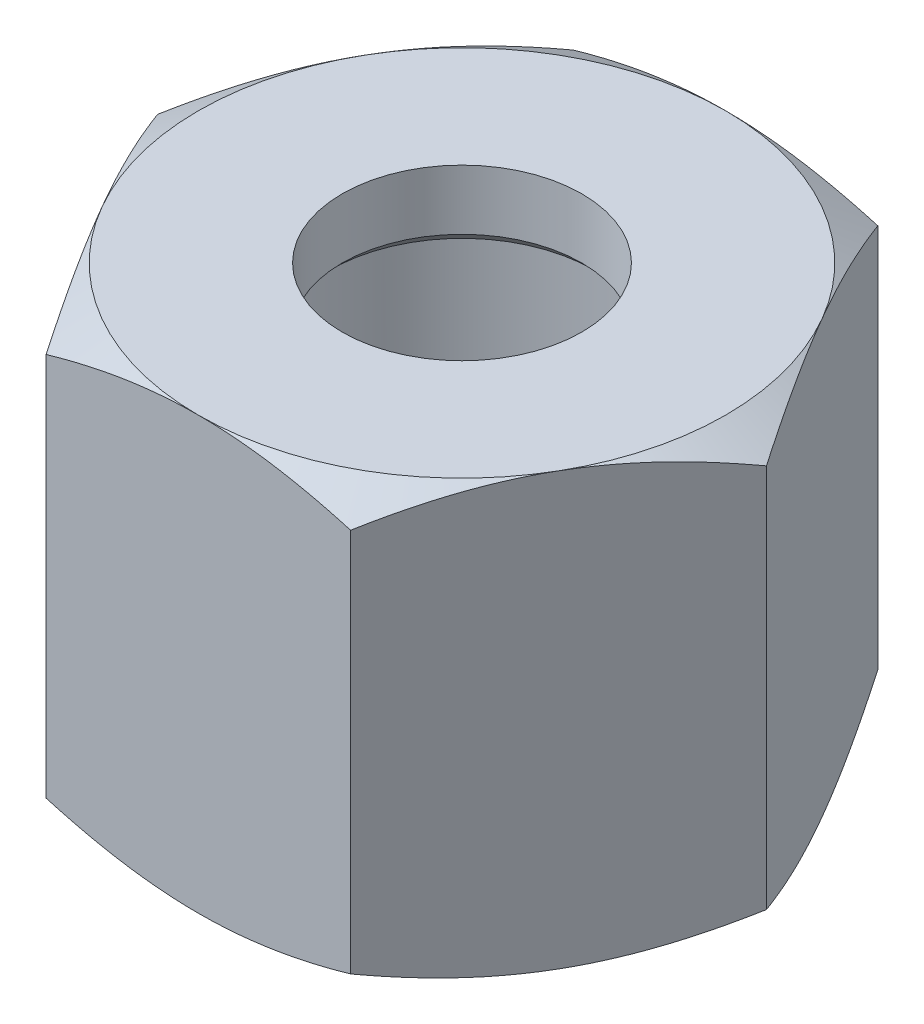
ISO-10303-21;
HEADER;
FILE_DESCRIPTION(('STEP AP214'),'2;1');
FILE_NAME('part.step','',(''),(''),'','','');
FILE_SCHEMA(('AUTOMOTIVE_DESIGN { 1 0 10303 214 1 1 1 1 }'));
ENDSEC;
DATA;
#1=APPLICATION_CONTEXT('core data for automotive mechanical design processes');
#2=APPLICATION_PROTOCOL_DEFINITION('international standard','automotive_design',2000,#1);
#3=PRODUCT_CONTEXT('',#1,'mechanical');
#4=PRODUCT('Part','Part','',(#3));
#5=PRODUCT_RELATED_PRODUCT_CATEGORY('part','',(#4));
#6=PRODUCT_DEFINITION_FORMATION('','',#4);
#7=PRODUCT_DEFINITION_CONTEXT('part definition',#1,'design');
#8=PRODUCT_DEFINITION('design','',#6,#7);
#9=PRODUCT_DEFINITION_SHAPE('','',#8);
#10=(LENGTH_UNIT() NAMED_UNIT(*) SI_UNIT(.MILLI.,.METRE.));
#11=(NAMED_UNIT(*) PLANE_ANGLE_UNIT() SI_UNIT($,.RADIAN.));
#12=(NAMED_UNIT(*) SI_UNIT($,.STERADIAN.) SOLID_ANGLE_UNIT());
#13=UNCERTAINTY_MEASURE_WITH_UNIT(LENGTH_MEASURE(1.E-05),#10,'distance_accuracy_value','');
#14=(GEOMETRIC_REPRESENTATION_CONTEXT(3) GLOBAL_UNCERTAINTY_ASSIGNED_CONTEXT((#13)) GLOBAL_UNIT_ASSIGNED_CONTEXT((#10,
#11,#12)) REPRESENTATION_CONTEXT('',''));
#15=CARTESIAN_POINT('',(0.,0.,0.));
#16=DIRECTION('',(0.,0.,1.));
#17=DIRECTION('',(1.,0.,0.));
#18=AXIS2_PLACEMENT_3D('',#15,#16,#17);
#19=CARTESIAN_POINT('',(6.35085296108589,18.,11.));
#20=DIRECTION('',(-0.866025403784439,0.,-0.5));
#21=DIRECTION('',(-0.5,0.,0.866025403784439));
#22=AXIS2_PLACEMENT_3D('',#19,#20,#21);
#23=PLANE('',#22);
#24=CARTESIAN_POINT('',(12.7018213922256,0.982547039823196,-0.000200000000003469));
#25=CARTESIAN_POINT('',(12.5622159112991,0.901959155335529,0.241603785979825));
#26=CARTESIAN_POINT('',(12.4220899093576,0.825028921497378,0.48430914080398));
#27=CARTESIAN_POINT('',(12.1407142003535,0.67949864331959,0.971666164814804));
#28=CARTESIAN_POINT('',(11.999464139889,0.610901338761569,1.21631844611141));
#29=CARTESIAN_POINT('',(11.5734380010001,0.418936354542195,1.9542173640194));
#30=CARTESIAN_POINT('',(11.2869801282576,0.309747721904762,2.45037695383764));
#31=CARTESIAN_POINT('',(10.8583090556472,0.181714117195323,3.19285703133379));
#32=CARTESIAN_POINT('',(10.7173765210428,0.145242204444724,3.43695934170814));
#33=CARTESIAN_POINT('',(10.4348589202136,0.0840813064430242,3.92629418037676));
#34=CARTESIAN_POINT('',(10.2932738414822,0.0593925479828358,4.17152673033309));
#35=CARTESIAN_POINT('',(10.0098676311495,0.0224303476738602,4.66240068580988));
#36=CARTESIAN_POINT('',(9.86804698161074,0.0101421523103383,4.90804125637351));
#37=CARTESIAN_POINT('',(9.58427426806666,-0.00175707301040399,5.39955001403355));
#38=CARTESIAN_POINT('',(9.44232220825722,-0.00136849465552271,5.64541819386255));
#39=CARTESIAN_POINT('',(9.17694200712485,0.0112011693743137,6.10507018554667));
#40=CARTESIAN_POINT('',(9.05349494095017,0.0218490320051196,6.31888677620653));
#41=CARTESIAN_POINT('',(8.80688473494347,0.0525316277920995,6.74602818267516));
#42=CARTESIAN_POINT('',(8.68372161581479,0.0725670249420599,6.9593529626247));
#43=CARTESIAN_POINT('',(8.43774623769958,0.12167538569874,7.38539481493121));
#44=CARTESIAN_POINT('',(8.31493435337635,0.150755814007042,7.59811123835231));
#45=CARTESIAN_POINT('',(8.0698863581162,0.217443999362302,8.02254681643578));
#46=CARTESIAN_POINT('',(7.94765028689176,0.255052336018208,8.23426590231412));
#47=CARTESIAN_POINT('',(7.5765957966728,0.38161991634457,8.87695113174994));
#48=CARTESIAN_POINT('',(7.32885191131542,0.483199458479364,9.30605612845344));
#49=CARTESIAN_POINT('',(6.83705838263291,0.713743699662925,10.1578675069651));
#50=CARTESIAN_POINT('',(6.59300244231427,0.842654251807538,10.580584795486));
#51=CARTESIAN_POINT('',(6.35073749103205,0.982547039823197,11.0002));
#52=B_SPLINE_CURVE_WITH_KNOTS('',3,(#24,#25,#26,#27,#28,#29,#30,#31,#32,#33,#34,#35,#36,#37,#38,
#39,#40,#41,#42,#43,#44,#45,#46,#47,#48,#49,#50,#51),.UNSPECIFIED.,.F.,.F.,(4,2,2,2,2,2,2,2,2,2,
2,2,2,4),(0.,0.871755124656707,1.74379610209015,3.49159027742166,4.34403665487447,
5.19649943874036,6.0479468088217,6.89936787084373,7.64056020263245,8.38180496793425,
9.12366309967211,9.86557166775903,11.3820155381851,12.8954827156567),.UNSPECIFIED.);
#53=CARTESIAN_POINT('',(12.7017059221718,0.982480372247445,0.));
#54=VERTEX_POINT('',#53);
#55=CARTESIAN_POINT('',(9.52627944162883,0.,5.5));
#56=VERTEX_POINT('',#55);
#57=EDGE_CURVE('E53',#54,#56,#52,.T.);
#58=ORIENTED_EDGE('',*,*,#57,.F.);
#59=DIRECTION('',(0.,-1.,0.));
#60=VECTOR('',#59,1.);
#61=CARTESIAN_POINT('',(12.7017059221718,18.,0.));
#62=LINE('',#61,#60);
#63=CARTESIAN_POINT('',(12.7017059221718,17.0175196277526,0.));
#64=VERTEX_POINT('',#63);
#65=EDGE_CURVE('E172',#64,#54,#62,.T.);
#66=ORIENTED_EDGE('',*,*,#65,.F.);
#67=CARTESIAN_POINT('',(6.35073749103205,17.0174529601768,11.0002));
#68=CARTESIAN_POINT('',(6.49034297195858,17.0980408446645,10.7583962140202));
#69=CARTESIAN_POINT('',(6.63046897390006,17.1749710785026,10.515690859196));
#70=CARTESIAN_POINT('',(6.91184468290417,17.3205013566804,10.0283338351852));
#71=CARTESIAN_POINT('',(7.05309474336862,17.3890986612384,9.78368155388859));
#72=CARTESIAN_POINT('',(7.47912088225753,17.5810636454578,9.04578263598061));
#73=CARTESIAN_POINT('',(7.76557875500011,17.6902522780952,8.54962304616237));
#74=CARTESIAN_POINT('',(8.19424982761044,17.8182858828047,7.80714296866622));
#75=CARTESIAN_POINT('',(8.33518236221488,17.8547577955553,7.56304065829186));
#76=CARTESIAN_POINT('',(8.61769996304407,17.915918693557,7.07370581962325));
#77=CARTESIAN_POINT('',(8.75928504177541,17.9406074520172,6.82847326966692));
#78=CARTESIAN_POINT('',(9.04269125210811,17.9775696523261,6.33759931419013));
#79=CARTESIAN_POINT('',(9.18451190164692,17.9898578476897,6.0919587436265));
#80=CARTESIAN_POINT('',(9.468284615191,18.0017570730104,5.60044998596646));
#81=CARTESIAN_POINT('',(9.61023667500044,18.0013684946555,5.35458180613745));
#82=CARTESIAN_POINT('',(9.87561687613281,17.9887988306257,4.89492981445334));
#83=CARTESIAN_POINT('',(9.99906394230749,17.9781509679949,4.68111322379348));
#84=CARTESIAN_POINT('',(10.2456741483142,17.9474683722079,4.25397181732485));
#85=CARTESIAN_POINT('',(10.3688372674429,17.9274329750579,4.04064703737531));
#86=CARTESIAN_POINT('',(10.6148126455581,17.8783246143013,3.6146051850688));
#87=CARTESIAN_POINT('',(10.7376245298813,17.849244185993,3.4018887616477));
#88=CARTESIAN_POINT('',(10.9826725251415,17.7825560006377,2.97745318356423));
#89=CARTESIAN_POINT('',(11.1049085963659,17.7449476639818,2.76573409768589));
#90=CARTESIAN_POINT('',(11.4759630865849,17.6183800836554,2.12304886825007));
#91=CARTESIAN_POINT('',(11.7237069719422,17.5168005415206,1.69394387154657));
#92=CARTESIAN_POINT('',(12.2155005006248,17.2862563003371,0.842132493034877));
#93=CARTESIAN_POINT('',(12.4595564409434,17.1573457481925,0.419415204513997));
#94=CARTESIAN_POINT('',(12.7018213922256,17.0174529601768,-0.000200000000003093));
#95=B_SPLINE_CURVE_WITH_KNOTS('',3,(#67,#68,#69,#70,#71,#72,#73,#74,#75,#76,#77,#78,#79,#80,#81,
#82,#83,#84,#85,#86,#87,#88,#89,#90,#91,#92,#93,#94),.UNSPECIFIED.,.F.,.F.,(4,2,2,2,2,2,2,2,2,2,
2,2,2,4),(0.,0.871755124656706,1.74379610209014,3.49159027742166,4.34403665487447,
5.19649943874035,6.0479468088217,6.89936787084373,7.64056020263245,8.38180496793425,
9.12366309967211,9.86557166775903,11.3820155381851,12.8954827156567),.UNSPECIFIED.);
#96=CARTESIAN_POINT('',(9.52627944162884,18.,5.5));
#97=VERTEX_POINT('',#96);
#98=EDGE_CURVE('E217',#97,#64,#95,.T.);
#99=ORIENTED_EDGE('',*,*,#98,.F.);
#100=CARTESIAN_POINT('',(6.35085296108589,17.0175196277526,11.));
#101=VERTEX_POINT('',#100);
#102=EDGE_CURVE('E163',#101,#97,#95,.T.);
#103=ORIENTED_EDGE('',*,*,#102,.F.);
#104=DIRECTION('',(0.,-1.,0.));
#105=VECTOR('',#104,1.);
#106=CARTESIAN_POINT('',(6.35085296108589,18.,11.));
#107=LINE('',#106,#105);
#108=CARTESIAN_POINT('',(6.35085296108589,0.982480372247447,11.));
#109=VERTEX_POINT('',#108);
#110=EDGE_CURVE('E158',#101,#109,#107,.T.);
#111=ORIENTED_EDGE('',*,*,#110,.T.);
#112=EDGE_CURVE('E150',#56,#109,#52,.T.);
#113=ORIENTED_EDGE('',*,*,#112,.F.);
#114=EDGE_LOOP('',(#58,#66,#99,#103,#111,#113));
#115=FACE_BOUND('',#114,.T.);
#116=ADVANCED_FACE('F38',(#115),#23,.F.);
#117=CARTESIAN_POINT('',(12.7017059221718,18.,0.));
#118=DIRECTION('',(-0.866025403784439,0.,0.5));
#119=DIRECTION('',(0.5,0.,0.866025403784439));
#120=AXIS2_PLACEMENT_3D('',#117,#118,#119);
#121=PLANE('',#120);
#122=CARTESIAN_POINT('',(6.35073749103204,0.982547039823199,-11.0002));
#123=CARTESIAN_POINT('',(6.49034297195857,0.901959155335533,-10.7583962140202));
#124=CARTESIAN_POINT('',(6.63046897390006,0.825028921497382,-10.515690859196));
#125=CARTESIAN_POINT('',(6.91184468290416,0.679498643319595,-10.0283338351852));
#126=CARTESIAN_POINT('',(7.05309474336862,0.610901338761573,-9.7836815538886));
#127=CARTESIAN_POINT('',(7.47912088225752,0.418936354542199,-9.04578263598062));
#128=CARTESIAN_POINT('',(7.7655787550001,0.309747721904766,-8.54962304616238));
#129=CARTESIAN_POINT('',(8.19424982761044,0.181714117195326,-7.80714296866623));
#130=CARTESIAN_POINT('',(8.33518236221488,0.145242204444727,-7.56304065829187));
#131=CARTESIAN_POINT('',(8.61769996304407,0.0840813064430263,-7.07370581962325));
#132=CARTESIAN_POINT('',(8.75928504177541,0.0593925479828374,-6.82847326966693));
#133=CARTESIAN_POINT('',(9.04269125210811,0.0224303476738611,-6.33759931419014));
#134=CARTESIAN_POINT('',(9.18451190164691,0.0101421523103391,-6.09195874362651));
#135=CARTESIAN_POINT('',(9.468284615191,-0.00175707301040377,-5.60044998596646));
#136=CARTESIAN_POINT('',(9.61023667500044,-0.00136849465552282,-5.35458180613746));
#137=CARTESIAN_POINT('',(9.87561687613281,0.0112011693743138,-4.89492981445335));
#138=CARTESIAN_POINT('',(9.99906394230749,0.0218490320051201,-4.68111322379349));
#139=CARTESIAN_POINT('',(10.2456741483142,0.0525316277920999,-4.25397181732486));
#140=CARTESIAN_POINT('',(10.3688372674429,0.0725670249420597,-4.04064703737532));
#141=CARTESIAN_POINT('',(10.6148126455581,0.121675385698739,-3.61460518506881));
#142=CARTESIAN_POINT('',(10.7376245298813,0.150755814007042,-3.40188876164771));
#143=CARTESIAN_POINT('',(10.9826725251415,0.217443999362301,-2.97745318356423));
#144=CARTESIAN_POINT('',(11.1049085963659,0.255052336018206,-2.7657340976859));
#145=CARTESIAN_POINT('',(11.4759630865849,0.381619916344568,-2.12304886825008));
#146=CARTESIAN_POINT('',(11.7237069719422,0.483199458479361,-1.69394387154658));
#147=CARTESIAN_POINT('',(12.2155005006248,0.713743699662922,-0.842132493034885));
#148=CARTESIAN_POINT('',(12.4595564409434,0.842654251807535,-0.419415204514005));
#149=CARTESIAN_POINT('',(12.7018213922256,0.982547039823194,0.000199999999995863));
#150=B_SPLINE_CURVE_WITH_KNOTS('',3,(#122,#123,#124,#125,#126,#127,#128,#129,#130,#131,#132,
#133,#134,#135,#136,#137,#138,#139,#140,#141,#142,#143,#144,#145,#146,#147,#148,#149),
.UNSPECIFIED.,.F.,.F.,(4,2,2,2,2,2,2,2,2,2,2,2,2,4),(0.,0.871755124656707,1.74379610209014,
3.49159027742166,4.34403665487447,5.19649943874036,6.0479468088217,6.89936787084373,
7.64056020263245,8.38180496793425,9.12366309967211,9.86557166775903,11.3820155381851,
12.8954827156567),.UNSPECIFIED.);
#151=CARTESIAN_POINT('',(6.35085296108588,0.982480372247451,-11.));
#152=VERTEX_POINT('',#151);
#153=CARTESIAN_POINT('',(9.52627944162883,0.,-5.5));
#154=VERTEX_POINT('',#153);
#155=EDGE_CURVE('E61',#152,#154,#150,.T.);
#156=ORIENTED_EDGE('',*,*,#155,.F.);
#157=DIRECTION('',(0.,-1.,0.));
#158=VECTOR('',#157,1.);
#159=CARTESIAN_POINT('',(6.35085296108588,18.,-11.));
#160=LINE('',#159,#158);
#161=CARTESIAN_POINT('',(6.35085296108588,17.0175196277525,-11.));
#162=VERTEX_POINT('',#161);
#163=EDGE_CURVE('E169',#162,#152,#160,.T.);
#164=ORIENTED_EDGE('',*,*,#163,.F.);
#165=CARTESIAN_POINT('',(12.7018213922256,17.0174529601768,0.000199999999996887));
#166=CARTESIAN_POINT('',(12.5622159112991,17.0980408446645,-0.241603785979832));
#167=CARTESIAN_POINT('',(12.4220899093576,17.1749710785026,-0.484309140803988));
#168=CARTESIAN_POINT('',(12.1407142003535,17.3205013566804,-0.971666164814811));
#169=CARTESIAN_POINT('',(11.999464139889,17.3890986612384,-1.21631844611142));
#170=CARTESIAN_POINT('',(11.5734380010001,17.5810636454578,-1.9542173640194));
#171=CARTESIAN_POINT('',(11.2869801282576,17.6902522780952,-2.45037695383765));
#172=CARTESIAN_POINT('',(10.8583090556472,17.8182858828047,-3.1928570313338));
#173=CARTESIAN_POINT('',(10.7173765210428,17.8547577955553,-3.43695934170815));
#174=CARTESIAN_POINT('',(10.4348589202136,17.915918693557,-3.92629418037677));
#175=CARTESIAN_POINT('',(10.2932738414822,17.9406074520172,-4.17152673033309));
#176=CARTESIAN_POINT('',(10.0098676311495,17.9775696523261,-4.66240068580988));
#177=CARTESIAN_POINT('',(9.86804698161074,17.9898578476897,-4.90804125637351));
#178=CARTESIAN_POINT('',(9.58427426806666,18.0017570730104,-5.39955001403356));
#179=CARTESIAN_POINT('',(9.44232220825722,18.0013684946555,-5.64541819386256));
#180=CARTESIAN_POINT('',(9.17694200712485,17.9887988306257,-6.10507018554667));
#181=CARTESIAN_POINT('',(9.05349494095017,17.9781509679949,-6.31888677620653));
#182=CARTESIAN_POINT('',(8.80688473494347,17.9474683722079,-6.74602818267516));
#183=CARTESIAN_POINT('',(8.68372161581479,17.9274329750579,-6.9593529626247));
#184=CARTESIAN_POINT('',(8.43774623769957,17.8783246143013,-7.38539481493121));
#185=CARTESIAN_POINT('',(8.31493435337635,17.849244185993,-7.59811123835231));
#186=CARTESIAN_POINT('',(8.0698863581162,17.7825560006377,-8.02254681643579));
#187=CARTESIAN_POINT('',(7.94765028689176,17.7449476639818,-8.23426590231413));
#188=CARTESIAN_POINT('',(7.57659579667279,17.6183800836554,-8.87695113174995));
#189=CARTESIAN_POINT('',(7.32885191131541,17.5168005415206,-9.30605612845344));
#190=CARTESIAN_POINT('',(6.8370583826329,17.2862563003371,-10.1578675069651));
#191=CARTESIAN_POINT('',(6.59300244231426,17.1573457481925,-10.580584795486));
#192=CARTESIAN_POINT('',(6.35073749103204,17.0174529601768,-11.0002));
#193=B_SPLINE_CURVE_WITH_KNOTS('',3,(#165,#166,#167,#168,#169,#170,#171,#172,#173,#174,#175,
#176,#177,#178,#179,#180,#181,#182,#183,#184,#185,#186,#187,#188,#189,#190,#191,#192),
.UNSPECIFIED.,.F.,.F.,(4,2,2,2,2,2,2,2,2,2,2,2,2,4),(0.,0.871755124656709,1.74379610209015,
3.49159027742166,4.34403665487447,5.19649943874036,6.0479468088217,6.89936787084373,
7.64056020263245,8.38180496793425,9.12366309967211,9.86557166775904,11.3820155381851,
12.8954827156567),.UNSPECIFIED.);
#194=CARTESIAN_POINT('',(9.52627944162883,18.,-5.50000000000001));
#195=VERTEX_POINT('',#194);
#196=EDGE_CURVE('E294',#195,#162,#193,.T.);
#197=ORIENTED_EDGE('',*,*,#196,.F.);
#198=EDGE_CURVE('E298',#64,#195,#193,.T.);
#199=ORIENTED_EDGE('',*,*,#198,.F.);
#200=ORIENTED_EDGE('',*,*,#65,.T.);
#201=EDGE_CURVE('E262',#154,#54,#150,.T.);
#202=ORIENTED_EDGE('',*,*,#201,.F.);
#203=EDGE_LOOP('',(#156,#164,#197,#199,#200,#202));
#204=FACE_BOUND('',#203,.T.);
#205=ADVANCED_FACE('F204',(#204),#121,.F.);
#206=CARTESIAN_POINT('',(6.35085296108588,18.,-11.));
#207=DIRECTION('',(0.,0.,1.));
#208=DIRECTION('',(1.,0.,0.));
#209=AXIS2_PLACEMENT_3D('',#206,#207,#208);
#210=PLANE('',#209);
#211=CARTESIAN_POINT('',(-16.8458280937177,5.26496849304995,-11.));
#212=CARTESIAN_POINT('',(-16.60434649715,5.14823483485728,-11.));
#213=CARTESIAN_POINT('',(-16.3625730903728,5.03210512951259,-11.));
#214=CARTESIAN_POINT('',(-15.8783810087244,4.80119224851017,-11.));
#215=CARTESIAN_POINT('',(-15.6359623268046,4.68640908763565,-11.));
#216=CARTESIAN_POINT('',(-14.9075749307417,4.34425411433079,-11.));
#217=CARTESIAN_POINT('',(-14.4205533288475,4.119114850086,-11.));
#218=CARTESIAN_POINT('',(-13.4403598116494,3.67495503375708,-11.));
#219=CARTESIAN_POINT('',(-12.9471686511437,3.4559768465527,-11.));
#220=CARTESIAN_POINT('',(-11.9567341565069,3.02741887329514,-11.));
#221=CARTESIAN_POINT('',(-11.459491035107,2.81783859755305,-11.));
#222=CARTESIAN_POINT('',(-10.4539778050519,2.40808867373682,-11.));
#223=CARTESIAN_POINT('',(-9.94564729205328,2.208066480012,-11.));
#224=CARTESIAN_POINT('',(-8.92298777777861,1.82368101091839,-11.));
#225=CARTESIAN_POINT('',(-8.40865811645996,1.63931947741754,-11.));
#226=CARTESIAN_POINT('',(-7.37425454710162,1.29120979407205,-11.));
#227=CARTESIAN_POINT('',(-6.85419550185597,1.12741784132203,-11.));
#228=CARTESIAN_POINT('',(-5.80663388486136,0.825757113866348,-11.));
#229=CARTESIAN_POINT('',(-5.27913372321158,0.687880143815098,-11.));
#230=CARTESIAN_POINT('',(-4.48220250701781,0.505547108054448,-11.));
#231=CARTESIAN_POINT('',(-4.21555592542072,0.448840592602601,-11.));
#232=CARTESIAN_POINT('',(-3.68048740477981,0.34448343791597,-11.));
#233=CARTESIAN_POINT('',(-3.41206550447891,0.296832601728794,-11.));
#234=CARTESIAN_POINT('',(-2.87362104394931,0.211430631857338,-11.));
#235=CARTESIAN_POINT('',(-2.60359835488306,0.173680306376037,-11.));
#236=CARTESIAN_POINT('',(-2.06227809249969,0.108840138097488,-11.));
#237=CARTESIAN_POINT('',(-1.7909805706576,0.0817498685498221,-11.));
#238=CARTESIAN_POINT('',(-1.24921360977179,0.0389565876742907,-11.));
#239=CARTESIAN_POINT('',(-0.978749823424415,0.0231824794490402,-11.));
#240=CARTESIAN_POINT('',(-0.43739753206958,0.00310533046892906,-11.));
#241=CARTESIAN_POINT('',(-0.166509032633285,-0.00119785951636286,-11.));
#242=CARTESIAN_POINT('',(0.375129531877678,0.00176893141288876,-11.));
#243=CARTESIAN_POINT('',(0.645879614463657,0.00903566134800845,-11.));
#244=CARTESIAN_POINT('',(1.18683741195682,0.0349616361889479,-11.));
#245=CARTESIAN_POINT('',(1.45704509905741,0.0536214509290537,-11.));
#246=CARTESIAN_POINT('',(2.11186732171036,0.112257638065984,-11.));
#247=CARTESIAN_POINT('',(2.49597946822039,0.157937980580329,-11.));
#248=CARTESIAN_POINT('',(3.2612619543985,0.269786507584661,-11.));
#249=CARTESIAN_POINT('',(3.64243146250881,0.33596028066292,-11.));
#250=CARTESIAN_POINT('',(4.40151370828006,0.48644872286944,-11.));
#251=CARTESIAN_POINT('',(4.77942301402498,0.570780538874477,-11.));
#252=CARTESIAN_POINT('',(5.53135425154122,0.755011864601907,-11.));
#253=CARTESIAN_POINT('',(5.90537654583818,0.854909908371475,-11.));
#254=CARTESIAN_POINT('',(6.65874919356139,1.0704958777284,-11.));
#255=CARTESIAN_POINT('',(7.03800528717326,1.18651093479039,-11.));
#256=CARTESIAN_POINT('',(7.7925087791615,1.430009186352,-11.));
#257=CARTESIAN_POINT('',(8.16775874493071,1.55748447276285,-11.));
#258=CARTESIAN_POINT('',(8.91274428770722,1.82126962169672,-11.));
#259=CARTESIAN_POINT('',(9.28249901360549,1.95752572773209,-11.));
#260=CARTESIAN_POINT('',(10.0191392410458,2.23803873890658,-11.));
#261=CARTESIAN_POINT('',(10.3860235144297,2.3822988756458,-11.));
#262=CARTESIAN_POINT('',(10.7515747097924,2.52976936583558,-11.));
#263=B_SPLINE_CURVE_WITH_KNOTS('',3,(#211,#212,#213,#214,#215,#216,#217,#218,#219,#220,#221,
#222,#223,#224,#225,#226,#227,#228,#229,#230,#231,#232,#233,#234,#235,#236,#237,#238,#239,#240,
#241,#242,#243,#244,#245,#246,#247,#248,#249,#250,#251,#252,#253,#254,#255,#256,#257,#258,#259,
#260,#261,#262),.UNSPECIFIED.,.F.,.F.,(4,2,2,2,2,2,2,2,2,2,2,2,2,2,2,2,2,2,2,2,2,2,2,2,2,4),(0.,
0.804648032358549,1.60930489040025,3.21888018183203,4.83766217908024,6.45635972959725,
8.09496684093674,9.73375596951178,11.368993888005,13.0037138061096,13.8214137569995,
14.6390959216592,15.4568448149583,16.274560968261,17.0870934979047,17.8996154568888,
18.7119091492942,19.5242434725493,20.6840538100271,21.8441807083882,23.0054079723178,
24.1665259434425,25.3561172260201,26.5448938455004,27.7269802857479,28.9095475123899),.UNSPECIFIED.);
#264=CARTESIAN_POINT('',(-6.35085296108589,0.982480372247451,-11.));
#265=VERTEX_POINT('',#264);
#266=CARTESIAN_POINT('',(0.,0.,-11.));
#267=VERTEX_POINT('',#266);
#268=EDGE_CURVE('E271',#265,#267,#263,.T.);
#269=ORIENTED_EDGE('',*,*,#268,.F.);
#270=DIRECTION('',(0.,-1.,0.));
#271=VECTOR('',#270,1.);
#272=CARTESIAN_POINT('',(-6.35085296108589,18.,-11.));
#273=LINE('',#272,#271);
#274=CARTESIAN_POINT('',(-6.35085296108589,17.0175196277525,-11.));
#275=VERTEX_POINT('',#274);
#276=EDGE_CURVE('E160',#275,#265,#273,.T.);
#277=ORIENTED_EDGE('',*,*,#276,.F.);
#278=CARTESIAN_POINT('',(-16.8458280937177,12.7350315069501,-11.));
#279=CARTESIAN_POINT('',(-16.60434649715,12.8517651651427,-11.));
#280=CARTESIAN_POINT('',(-16.3625730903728,12.9678948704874,-11.));
#281=CARTESIAN_POINT('',(-15.8783810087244,13.1988077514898,-11.));
#282=CARTESIAN_POINT('',(-15.6359623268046,13.3135909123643,-11.));
#283=CARTESIAN_POINT('',(-14.9075749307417,13.6557458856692,-11.));
#284=CARTESIAN_POINT('',(-14.4205533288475,13.880885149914,-11.));
#285=CARTESIAN_POINT('',(-13.4403598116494,14.3250449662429,-11.));
#286=CARTESIAN_POINT('',(-12.9471686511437,14.5440231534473,-11.));
#287=CARTESIAN_POINT('',(-11.9567341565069,14.9725811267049,-11.));
#288=CARTESIAN_POINT('',(-11.459491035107,15.182161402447,-11.));
#289=CARTESIAN_POINT('',(-10.4539778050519,15.5919113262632,-11.));
#290=CARTESIAN_POINT('',(-9.94564729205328,15.791933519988,-11.));
#291=CARTESIAN_POINT('',(-8.92298777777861,16.1763189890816,-11.));
#292=CARTESIAN_POINT('',(-8.40865811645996,16.3606805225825,-11.));
#293=CARTESIAN_POINT('',(-7.37425454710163,16.708790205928,-11.));
#294=CARTESIAN_POINT('',(-6.85419550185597,16.872582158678,-11.));
#295=CARTESIAN_POINT('',(-5.80663388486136,17.1742428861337,-11.));
#296=CARTESIAN_POINT('',(-5.27913372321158,17.3121198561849,-11.));
#297=CARTESIAN_POINT('',(-4.48220250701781,17.4944528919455,-11.));
#298=CARTESIAN_POINT('',(-4.21555592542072,17.5511594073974,-11.));
#299=CARTESIAN_POINT('',(-3.68048740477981,17.655516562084,-11.));
#300=CARTESIAN_POINT('',(-3.41206550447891,17.7031673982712,-11.));
#301=CARTESIAN_POINT('',(-2.87362104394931,17.7885693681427,-11.));
#302=CARTESIAN_POINT('',(-2.60359835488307,17.826319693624,-11.));
#303=CARTESIAN_POINT('',(-2.06227809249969,17.8911598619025,-11.));
#304=CARTESIAN_POINT('',(-1.7909805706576,17.9182501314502,-11.));
#305=CARTESIAN_POINT('',(-1.24921360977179,17.9610434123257,-11.));
#306=CARTESIAN_POINT('',(-0.978749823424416,17.976817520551,-11.));
#307=CARTESIAN_POINT('',(-0.437397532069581,17.9968946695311,-11.));
#308=CARTESIAN_POINT('',(-0.166509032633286,18.0011978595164,-11.));
#309=CARTESIAN_POINT('',(0.375129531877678,17.9982310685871,-11.));
#310=CARTESIAN_POINT('',(0.645879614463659,17.990964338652,-11.));
#311=CARTESIAN_POINT('',(1.18683741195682,17.9650383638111,-11.));
#312=CARTESIAN_POINT('',(1.45704509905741,17.9463785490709,-11.));
#313=CARTESIAN_POINT('',(2.11186732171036,17.887742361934,-11.));
#314=CARTESIAN_POINT('',(2.49597946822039,17.8420620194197,-11.));
#315=CARTESIAN_POINT('',(3.26126195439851,17.7302134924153,-11.));
#316=CARTESIAN_POINT('',(3.64243146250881,17.6640397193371,-11.));
#317=CARTESIAN_POINT('',(4.40151370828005,17.5135512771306,-11.));
#318=CARTESIAN_POINT('',(4.77942301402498,17.4292194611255,-11.));
#319=CARTESIAN_POINT('',(5.53135425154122,17.2449881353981,-11.));
#320=CARTESIAN_POINT('',(5.90537654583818,17.1450900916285,-11.));
#321=CARTESIAN_POINT('',(6.65874919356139,16.9295041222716,-11.));
#322=CARTESIAN_POINT('',(7.03800528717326,16.8134890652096,-11.));
#323=CARTESIAN_POINT('',(7.7925087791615,16.569990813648,-11.));
#324=CARTESIAN_POINT('',(8.1677587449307,16.4425155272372,-11.));
#325=CARTESIAN_POINT('',(8.91274428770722,16.1787303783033,-11.));
#326=CARTESIAN_POINT('',(9.28249901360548,16.0424742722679,-11.));
#327=CARTESIAN_POINT('',(10.0191392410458,15.7619612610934,-11.));
#328=CARTESIAN_POINT('',(10.3860235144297,15.6177011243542,-11.));
#329=CARTESIAN_POINT('',(10.7515747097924,15.4702306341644,-11.));
#330=B_SPLINE_CURVE_WITH_KNOTS('',3,(#278,#279,#280,#281,#282,#283,#284,#285,#286,#287,#288,
#289,#290,#291,#292,#293,#294,#295,#296,#297,#298,#299,#300,#301,#302,#303,#304,#305,#306,#307,
#308,#309,#310,#311,#312,#313,#314,#315,#316,#317,#318,#319,#320,#321,#322,#323,#324,#325,#326,
#327,#328,#329),.UNSPECIFIED.,.F.,.F.,(4,2,2,2,2,2,2,2,2,2,2,2,2,2,2,2,2,2,2,2,2,2,2,2,2,4),(0.,
0.804648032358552,1.60930489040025,3.21888018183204,4.83766217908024,6.45635972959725,
8.09496684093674,9.73375596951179,11.368993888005,13.0037138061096,13.8214137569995,
14.6390959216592,15.4568448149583,16.2745609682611,17.0870934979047,17.8996154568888,
18.7119091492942,19.5242434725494,20.6840538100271,21.8441807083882,23.0054079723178,
24.1665259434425,25.3561172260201,26.5448938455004,27.726980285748,28.9095475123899),.UNSPECIFIED.);
#331=CARTESIAN_POINT('',(0.,18.,-11.));
#332=VERTEX_POINT('',#331);
#333=EDGE_CURVE('E282',#332,#275,#330,.F.);
#334=ORIENTED_EDGE('',*,*,#333,.F.);
#335=EDGE_CURVE('E287',#162,#332,#330,.F.);
#336=ORIENTED_EDGE('',*,*,#335,.F.);
#337=ORIENTED_EDGE('',*,*,#163,.T.);
#338=EDGE_CURVE('E266',#267,#152,#263,.T.);
#339=ORIENTED_EDGE('',*,*,#338,.F.);
#340=EDGE_LOOP('',(#269,#277,#334,#336,#337,#339));
#341=FACE_BOUND('',#340,.T.);
#342=ADVANCED_FACE('F210',(#341),#210,.F.);
#343=CARTESIAN_POINT('',(-6.35085296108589,18.,-11.));
#344=DIRECTION('',(0.866025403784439,0.,0.5));
#345=DIRECTION('',(0.5,0.,-0.866025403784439));
#346=AXIS2_PLACEMENT_3D('',#343,#344,#345);
#347=PLANE('',#346);
#348=CARTESIAN_POINT('',(-12.7018213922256,0.982547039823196,0.000200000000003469));
#349=CARTESIAN_POINT('',(-12.5622159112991,0.90195915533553,-0.241603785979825));
#350=CARTESIAN_POINT('',(-12.4220899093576,0.825028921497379,-0.48430914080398));
#351=CARTESIAN_POINT('',(-12.1407142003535,0.679498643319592,-0.971666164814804));
#352=CARTESIAN_POINT('',(-11.999464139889,0.610901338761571,-1.21631844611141));
#353=CARTESIAN_POINT('',(-11.5734380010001,0.418936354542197,-1.9542173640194));
#354=CARTESIAN_POINT('',(-11.2869801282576,0.309747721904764,-2.45037695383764));
#355=CARTESIAN_POINT('',(-10.8583090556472,0.181714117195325,-3.19285703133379));
#356=CARTESIAN_POINT('',(-10.7173765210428,0.145242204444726,-3.43695934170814));
#357=CARTESIAN_POINT('',(-10.4348589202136,0.0840813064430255,-3.92629418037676));
#358=CARTESIAN_POINT('',(-10.2932738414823,0.0593925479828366,-4.17152673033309));
#359=CARTESIAN_POINT('',(-10.0098676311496,0.0224303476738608,-4.66240068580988));
#360=CARTESIAN_POINT('',(-9.86804698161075,0.0101421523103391,-4.90804125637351));
#361=CARTESIAN_POINT('',(-9.58427426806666,-0.00175707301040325,-5.39955001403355));
#362=CARTESIAN_POINT('',(-9.44232220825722,-0.00136849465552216,-5.64541819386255));
#363=CARTESIAN_POINT('',(-9.17694200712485,0.0112011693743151,-6.10507018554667));
#364=CARTESIAN_POINT('',(-9.05349494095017,0.0218490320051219,-6.31888677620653));
#365=CARTESIAN_POINT('',(-8.80688473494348,0.0525316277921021,-6.74602818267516));
#366=CARTESIAN_POINT('',(-8.68372161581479,0.072567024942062,-6.95935296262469));
#367=CARTESIAN_POINT('',(-8.43774623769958,0.121675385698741,-7.38539481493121));
#368=CARTESIAN_POINT('',(-8.31493435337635,0.150755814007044,-7.59811123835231));
#369=CARTESIAN_POINT('',(-8.06988635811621,0.217443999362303,-8.02254681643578));
#370=CARTESIAN_POINT('',(-7.94765028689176,0.255052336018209,-8.23426590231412));
#371=CARTESIAN_POINT('',(-7.5765957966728,0.381619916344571,-8.87695113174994));
#372=CARTESIAN_POINT('',(-7.32885191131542,0.483199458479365,-9.30605612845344));
#373=CARTESIAN_POINT('',(-6.83705838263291,0.713743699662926,-10.1578675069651));
#374=CARTESIAN_POINT('',(-6.59300244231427,0.84265425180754,-10.580584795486));
#375=CARTESIAN_POINT('',(-6.35073749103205,0.982547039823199,-11.0002));
#376=B_SPLINE_CURVE_WITH_KNOTS('',3,(#348,#349,#350,#351,#352,#353,#354,#355,#356,#357,#358,
#359,#360,#361,#362,#363,#364,#365,#366,#367,#368,#369,#370,#371,#372,#373,#374,#375),
.UNSPECIFIED.,.F.,.F.,(4,2,2,2,2,2,2,2,2,2,2,2,2,4),(0.,0.871755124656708,1.74379610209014,
3.49159027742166,4.34403665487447,5.19649943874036,6.0479468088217,6.89936787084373,
7.64056020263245,8.38180496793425,9.12366309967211,9.86557166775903,11.3820155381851,
12.8954827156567),.UNSPECIFIED.);
#377=CARTESIAN_POINT('',(-12.7017059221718,0.982480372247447,0.));
#378=VERTEX_POINT('',#377);
#379=CARTESIAN_POINT('',(-9.52627944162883,0.,-5.5));
#380=VERTEX_POINT('',#379);
#381=EDGE_CURVE('E233',#378,#380,#376,.T.);
#382=ORIENTED_EDGE('',*,*,#381,.F.);
#383=DIRECTION('',(0.,-1.,0.));
#384=VECTOR('',#383,1.);
#385=CARTESIAN_POINT('',(-12.7017059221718,18.,0.));
#386=LINE('',#385,#384);
#387=CARTESIAN_POINT('',(-12.7017059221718,17.0175196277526,0.));
#388=VERTEX_POINT('',#387);
#389=EDGE_CURVE('E157',#388,#378,#386,.T.);
#390=ORIENTED_EDGE('',*,*,#389,.F.);
#391=CARTESIAN_POINT('',(-6.35073749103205,17.0174529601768,-11.0002));
#392=CARTESIAN_POINT('',(-6.49034297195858,17.0980408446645,-10.7583962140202));
#393=CARTESIAN_POINT('',(-6.63046897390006,17.1749710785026,-10.515690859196));
#394=CARTESIAN_POINT('',(-6.91184468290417,17.3205013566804,-10.0283338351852));
#395=CARTESIAN_POINT('',(-7.05309474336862,17.3890986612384,-9.7836815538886));
#396=CARTESIAN_POINT('',(-7.47912088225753,17.5810636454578,-9.04578263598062));
#397=CARTESIAN_POINT('',(-7.76557875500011,17.6902522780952,-8.54962304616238));
#398=CARTESIAN_POINT('',(-8.19424982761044,17.8182858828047,-7.80714296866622));
#399=CARTESIAN_POINT('',(-8.33518236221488,17.8547577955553,-7.56304065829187));
#400=CARTESIAN_POINT('',(-8.61769996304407,17.915918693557,-7.07370581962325));
#401=CARTESIAN_POINT('',(-8.75928504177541,17.9406074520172,-6.82847326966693));
#402=CARTESIAN_POINT('',(-9.04269125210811,17.9775696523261,-6.33759931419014));
#403=CARTESIAN_POINT('',(-9.18451190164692,17.9898578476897,-6.09195874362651));
#404=CARTESIAN_POINT('',(-9.46828461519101,18.0017570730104,-5.60044998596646));
#405=CARTESIAN_POINT('',(-9.61023667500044,18.0013684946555,-5.35458180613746));
#406=CARTESIAN_POINT('',(-9.87561687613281,17.9887988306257,-4.89492981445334));
#407=CARTESIAN_POINT('',(-9.99906394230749,17.9781509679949,-4.68111322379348));
#408=CARTESIAN_POINT('',(-10.2456741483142,17.9474683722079,-4.25397181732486));
#409=CARTESIAN_POINT('',(-10.3688372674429,17.9274329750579,-4.04064703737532));
#410=CARTESIAN_POINT('',(-10.6148126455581,17.8783246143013,-3.6146051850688));
#411=CARTESIAN_POINT('',(-10.7376245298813,17.849244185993,-3.4018887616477));
#412=CARTESIAN_POINT('',(-10.9826725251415,17.7825560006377,-2.97745318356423));
#413=CARTESIAN_POINT('',(-11.1049085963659,17.7449476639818,-2.76573409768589));
#414=CARTESIAN_POINT('',(-11.4759630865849,17.6183800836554,-2.12304886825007));
#415=CARTESIAN_POINT('',(-11.7237069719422,17.5168005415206,-1.69394387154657));
#416=CARTESIAN_POINT('',(-12.2155005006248,17.2862563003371,-0.842132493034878));
#417=CARTESIAN_POINT('',(-12.4595564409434,17.1573457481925,-0.419415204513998));
#418=CARTESIAN_POINT('',(-12.7018213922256,17.0174529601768,0.000200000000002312));
#419=B_SPLINE_CURVE_WITH_KNOTS('',3,(#391,#392,#393,#394,#395,#396,#397,#398,#399,#400,#401,
#402,#403,#404,#405,#406,#407,#408,#409,#410,#411,#412,#413,#414,#415,#416,#417,#418),
.UNSPECIFIED.,.F.,.F.,(4,2,2,2,2,2,2,2,2,2,2,2,2,4),(0.,0.871755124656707,1.74379610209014,
3.49159027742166,4.34403665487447,5.19649943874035,6.0479468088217,6.89936787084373,
7.64056020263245,8.38180496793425,9.12366309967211,9.86557166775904,11.3820155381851,
12.8954827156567),.UNSPECIFIED.);
#420=CARTESIAN_POINT('',(-9.52627944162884,18.,-5.5));
#421=VERTEX_POINT('',#420);
#422=EDGE_CURVE('E289',#421,#388,#419,.T.);
#423=ORIENTED_EDGE('',*,*,#422,.F.);
#424=EDGE_CURVE('E288',#275,#421,#419,.T.);
#425=ORIENTED_EDGE('',*,*,#424,.F.);
#426=ORIENTED_EDGE('',*,*,#276,.T.);
#427=EDGE_CURVE('E272',#380,#265,#376,.T.);
#428=ORIENTED_EDGE('',*,*,#427,.F.);
#429=EDGE_LOOP('',(#382,#390,#423,#425,#426,#428));
#430=FACE_BOUND('',#429,.T.);
#431=ADVANCED_FACE('F277',(#430),#347,.F.);
#432=CARTESIAN_POINT('',(-12.7017059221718,18.,0.));
#433=DIRECTION('',(0.866025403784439,0.,-0.5));
#434=DIRECTION('',(-0.5,0.,-0.866025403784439));
#435=AXIS2_PLACEMENT_3D('',#432,#433,#434);
#436=PLANE('',#435);
#437=CARTESIAN_POINT('',(-6.35073749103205,0.982547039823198,11.0002));
#438=CARTESIAN_POINT('',(-6.49034297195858,0.901959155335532,10.7583962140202));
#439=CARTESIAN_POINT('',(-6.63046897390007,0.825028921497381,10.515690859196));
#440=CARTESIAN_POINT('',(-6.91184468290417,0.679498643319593,10.0283338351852));
#441=CARTESIAN_POINT('',(-7.05309474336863,0.610901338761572,9.78368155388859));
#442=CARTESIAN_POINT('',(-7.47912088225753,0.418936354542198,9.04578263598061));
#443=CARTESIAN_POINT('',(-7.76557875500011,0.309747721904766,8.54962304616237));
#444=CARTESIAN_POINT('',(-8.19424982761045,0.181714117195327,7.80714296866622));
#445=CARTESIAN_POINT('',(-8.33518236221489,0.145242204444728,7.56304065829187));
#446=CARTESIAN_POINT('',(-8.61769996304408,0.0840813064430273,7.07370581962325));
#447=CARTESIAN_POINT('',(-8.75928504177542,0.0593925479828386,6.82847326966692));
#448=CARTESIAN_POINT('',(-9.04269125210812,0.0224303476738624,6.33759931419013));
#449=CARTESIAN_POINT('',(-9.18451190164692,0.0101421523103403,6.0919587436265));
#450=CARTESIAN_POINT('',(-9.46828461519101,-0.00175707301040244,5.60044998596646));
#451=CARTESIAN_POINT('',(-9.61023667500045,-0.00136849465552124,5.35458180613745));
#452=CARTESIAN_POINT('',(-9.87561687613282,0.0112011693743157,4.89492981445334));
#453=CARTESIAN_POINT('',(-9.9990639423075,0.0218490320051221,4.68111322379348));
#454=CARTESIAN_POINT('',(-10.2456741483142,0.0525316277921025,4.25397181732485));
#455=CARTESIAN_POINT('',(-10.3688372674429,0.0725670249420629,4.04064703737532));
#456=CARTESIAN_POINT('',(-10.6148126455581,0.121675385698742,3.6146051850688));
#457=CARTESIAN_POINT('',(-10.7376245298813,0.150755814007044,3.4018887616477));
#458=CARTESIAN_POINT('',(-10.9826725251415,0.217443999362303,2.97745318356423));
#459=CARTESIAN_POINT('',(-11.1049085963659,0.255052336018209,2.76573409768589));
#460=CARTESIAN_POINT('',(-11.4759630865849,0.381619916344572,2.12304886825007));
#461=CARTESIAN_POINT('',(-11.7237069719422,0.483199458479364,1.69394387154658));
#462=CARTESIAN_POINT('',(-12.2155005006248,0.713743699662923,0.842132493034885));
#463=CARTESIAN_POINT('',(-12.4595564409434,0.842654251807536,0.419415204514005));
#464=CARTESIAN_POINT('',(-12.7018213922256,0.982547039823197,-0.000199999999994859));
#465=B_SPLINE_CURVE_WITH_KNOTS('',3,(#437,#438,#439,#440,#441,#442,#443,#444,#445,#446,#447,
#448,#449,#450,#451,#452,#453,#454,#455,#456,#457,#458,#459,#460,#461,#462,#463,#464),
.UNSPECIFIED.,.F.,.F.,(4,2,2,2,2,2,2,2,2,2,2,2,2,4),(0.,0.871755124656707,1.74379610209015,
3.49159027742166,4.34403665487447,5.19649943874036,6.0479468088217,6.89936787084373,
7.64056020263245,8.38180496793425,9.12366309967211,9.86557166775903,11.3820155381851,
12.8954827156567),.UNSPECIFIED.);
#466=CARTESIAN_POINT('',(-6.35085296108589,0.982480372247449,11.));
#467=VERTEX_POINT('',#466);
#468=CARTESIAN_POINT('',(-9.52627944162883,0.,5.5));
#469=VERTEX_POINT('',#468);
#470=EDGE_CURVE('E132',#467,#469,#465,.T.);
#471=ORIENTED_EDGE('',*,*,#470,.F.);
#472=DIRECTION('',(0.,-1.,0.));
#473=VECTOR('',#472,1.);
#474=CARTESIAN_POINT('',(-6.35085296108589,18.,11.));
#475=LINE('',#474,#473);
#476=CARTESIAN_POINT('',(-6.35085296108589,17.0175196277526,11.));
#477=VERTEX_POINT('',#476);
#478=EDGE_CURVE('E147',#477,#467,#475,.T.);
#479=ORIENTED_EDGE('',*,*,#478,.F.);
#480=CARTESIAN_POINT('',(-12.7018213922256,17.0174529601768,-0.000199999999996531));
#481=CARTESIAN_POINT('',(-12.5622159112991,17.0980408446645,0.241603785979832));
#482=CARTESIAN_POINT('',(-12.4220899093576,17.1749710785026,0.484309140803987));
#483=CARTESIAN_POINT('',(-12.1407142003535,17.3205013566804,0.971666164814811));
#484=CARTESIAN_POINT('',(-11.999464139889,17.3890986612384,1.21631844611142));
#485=CARTESIAN_POINT('',(-11.5734380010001,17.5810636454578,1.95421736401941));
#486=CARTESIAN_POINT('',(-11.2869801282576,17.6902522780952,2.45037695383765));
#487=CARTESIAN_POINT('',(-10.8583090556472,17.8182858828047,3.1928570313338));
#488=CARTESIAN_POINT('',(-10.7173765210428,17.8547577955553,3.43695934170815));
#489=CARTESIAN_POINT('',(-10.4348589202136,17.915918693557,3.92629418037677));
#490=CARTESIAN_POINT('',(-10.2932738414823,17.9406074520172,4.17152673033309));
#491=CARTESIAN_POINT('',(-10.0098676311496,17.9775696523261,4.66240068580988));
#492=CARTESIAN_POINT('',(-9.86804698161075,17.9898578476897,4.90804125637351));
#493=CARTESIAN_POINT('',(-9.58427426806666,18.0017570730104,5.39955001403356));
#494=CARTESIAN_POINT('',(-9.44232220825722,18.0013684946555,5.64541819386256));
#495=CARTESIAN_POINT('',(-9.17694200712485,17.9887988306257,6.10507018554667));
#496=CARTESIAN_POINT('',(-9.05349494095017,17.9781509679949,6.31888677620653));
#497=CARTESIAN_POINT('',(-8.80688473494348,17.9474683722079,6.74602818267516));
#498=CARTESIAN_POINT('',(-8.68372161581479,17.9274329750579,6.9593529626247));
#499=CARTESIAN_POINT('',(-8.43774623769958,17.8783246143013,7.38539481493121));
#500=CARTESIAN_POINT('',(-8.31493435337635,17.849244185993,7.59811123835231));
#501=CARTESIAN_POINT('',(-8.06988635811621,17.7825560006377,8.02254681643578));
#502=CARTESIAN_POINT('',(-7.94765028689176,17.7449476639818,8.23426590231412));
#503=CARTESIAN_POINT('',(-7.5765957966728,17.6183800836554,8.87695113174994));
#504=CARTESIAN_POINT('',(-7.32885191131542,17.5168005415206,9.30605612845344));
#505=CARTESIAN_POINT('',(-6.83705838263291,17.2862563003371,10.1578675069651));
#506=CARTESIAN_POINT('',(-6.59300244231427,17.1573457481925,10.580584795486));
#507=CARTESIAN_POINT('',(-6.35073749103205,17.0174529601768,11.0002));
#508=B_SPLINE_CURVE_WITH_KNOTS('',3,(#480,#481,#482,#483,#484,#485,#486,#487,#488,#489,#490,
#491,#492,#493,#494,#495,#496,#497,#498,#499,#500,#501,#502,#503,#504,#505,#506,#507),
.UNSPECIFIED.,.F.,.F.,(4,2,2,2,2,2,2,2,2,2,2,2,2,4),(0.,0.871755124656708,1.74379610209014,
3.49159027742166,4.34403665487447,5.19649943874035,6.0479468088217,6.89936787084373,
7.64056020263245,8.38180496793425,9.12366309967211,9.86557166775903,11.3820155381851,
12.8954827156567),.UNSPECIFIED.);
#509=CARTESIAN_POINT('',(-9.52627944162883,18.,5.5));
#510=VERTEX_POINT('',#509);
#511=EDGE_CURVE('E332',#510,#477,#508,.T.);
#512=ORIENTED_EDGE('',*,*,#511,.F.);
#513=EDGE_CURVE('E329',#388,#510,#508,.T.);
#514=ORIENTED_EDGE('',*,*,#513,.F.);
#515=ORIENTED_EDGE('',*,*,#389,.T.);
#516=EDGE_CURVE('E149',#469,#378,#465,.T.);
#517=ORIENTED_EDGE('',*,*,#516,.F.);
#518=EDGE_LOOP('',(#471,#479,#512,#514,#515,#517));
#519=FACE_BOUND('',#518,.T.);
#520=ADVANCED_FACE('F145',(#519),#436,.F.);
#521=CARTESIAN_POINT('',(-6.35085296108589,18.,11.));
#522=DIRECTION('',(0.,0.,-1.));
#523=DIRECTION('',(-1.,0.,0.));
#524=AXIS2_PLACEMENT_3D('',#521,#522,#523);
#525=PLANE('',#524);
#526=CARTESIAN_POINT('',(-16.8458280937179,5.26496849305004,11.));
#527=CARTESIAN_POINT('',(-16.6043464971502,5.14823483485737,11.));
#528=CARTESIAN_POINT('',(-16.362573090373,5.03210512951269,11.));
#529=CARTESIAN_POINT('',(-15.8783810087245,4.80119224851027,11.));
#530=CARTESIAN_POINT('',(-15.6359623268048,4.68640908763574,11.));
#531=CARTESIAN_POINT('',(-14.9075749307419,4.34425411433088,11.));
#532=CARTESIAN_POINT('',(-14.4205533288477,4.11911485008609,11.));
#533=CARTESIAN_POINT('',(-13.4403598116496,3.67495503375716,11.));
#534=CARTESIAN_POINT('',(-12.9471686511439,3.45597684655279,11.));
#535=CARTESIAN_POINT('',(-11.9567341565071,3.02741887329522,11.));
#536=CARTESIAN_POINT('',(-11.4594910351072,2.81783859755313,11.));
#537=CARTESIAN_POINT('',(-10.4539778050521,2.40808867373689,11.));
#538=CARTESIAN_POINT('',(-9.94564729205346,2.20806648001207,11.));
#539=CARTESIAN_POINT('',(-8.92298777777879,1.82368101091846,11.));
#540=CARTESIAN_POINT('',(-8.40865811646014,1.6393194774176,11.));
#541=CARTESIAN_POINT('',(-7.3742545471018,1.29120979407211,11.));
#542=CARTESIAN_POINT('',(-6.85419550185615,1.12741784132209,11.));
#543=CARTESIAN_POINT('',(-5.80663388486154,0.825757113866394,11.));
#544=CARTESIAN_POINT('',(-5.27913372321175,0.687880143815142,11.));
#545=CARTESIAN_POINT('',(-4.48220250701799,0.505547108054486,11.));
#546=CARTESIAN_POINT('',(-4.2155559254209,0.448840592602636,11.));
#547=CARTESIAN_POINT('',(-3.68048740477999,0.344483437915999,11.));
#548=CARTESIAN_POINT('',(-3.41206550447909,0.296832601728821,11.));
#549=CARTESIAN_POINT('',(-2.87362104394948,0.21143063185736,11.));
#550=CARTESIAN_POINT('',(-2.60359835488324,0.173680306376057,11.));
#551=CARTESIAN_POINT('',(-2.06227809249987,0.108840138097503,11.));
#552=CARTESIAN_POINT('',(-1.79098057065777,0.0817498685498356,11.));
#553=CARTESIAN_POINT('',(-1.24921360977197,0.0389565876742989,11.));
#554=CARTESIAN_POINT('',(-0.978749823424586,0.0231824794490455,11.));
#555=CARTESIAN_POINT('',(-0.437397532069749,0.00310533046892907,11.));
#556=CARTESIAN_POINT('',(-0.166509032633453,-0.0011978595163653,11.));
#557=CARTESIAN_POINT('',(0.375129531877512,0.00176893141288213,11.));
#558=CARTESIAN_POINT('',(0.645879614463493,0.00903566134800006,11.));
#559=CARTESIAN_POINT('',(1.18683741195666,0.0349616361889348,11.));
#560=CARTESIAN_POINT('',(1.45704509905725,0.0536214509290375,11.));
#561=CARTESIAN_POINT('',(2.11186732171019,0.11225763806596,11.));
#562=CARTESIAN_POINT('',(2.49597946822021,0.157937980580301,11.));
#563=CARTESIAN_POINT('',(3.26126195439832,0.269786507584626,11.));
#564=CARTESIAN_POINT('',(3.64243146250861,0.335960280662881,11.));
#565=CARTESIAN_POINT('',(4.40151370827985,0.486448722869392,11.));
#566=CARTESIAN_POINT('',(4.77942301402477,0.570780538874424,11.));
#567=CARTESIAN_POINT('',(5.531354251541,0.755011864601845,11.));
#568=CARTESIAN_POINT('',(5.90537654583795,0.854909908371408,11.));
#569=CARTESIAN_POINT('',(6.65874919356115,1.07049587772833,11.));
#570=CARTESIAN_POINT('',(7.03800528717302,1.18651093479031,11.));
#571=CARTESIAN_POINT('',(7.79250877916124,1.43000918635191,11.));
#572=CARTESIAN_POINT('',(8.16775874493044,1.55748447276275,11.));
#573=CARTESIAN_POINT('',(8.91274428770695,1.82126962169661,11.));
#574=CARTESIAN_POINT('',(9.28249901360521,1.95752572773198,11.));
#575=CARTESIAN_POINT('',(10.0191392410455,2.23803873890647,11.));
#576=CARTESIAN_POINT('',(10.3860235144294,2.38229887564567,11.));
#577=CARTESIAN_POINT('',(10.7515747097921,2.52976936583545,11.));
#578=B_SPLINE_CURVE_WITH_KNOTS('',3,(#526,#527,#528,#529,#530,#531,#532,#533,#534,#535,#536,
#537,#538,#539,#540,#541,#542,#543,#544,#545,#546,#547,#548,#549,#550,#551,#552,#553,#554,#555,
#556,#557,#558,#559,#560,#561,#562,#563,#564,#565,#566,#567,#568,#569,#570,#571,#572,#573,#574,
#575,#576,#577),.UNSPECIFIED.,.F.,.F.,(4,2,2,2,2,2,2,2,2,2,2,2,2,2,2,2,2,2,2,2,2,2,2,2,2,4),(0.,
0.804648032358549,1.60930489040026,3.21888018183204,4.83766217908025,6.45635972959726,
8.09496684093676,9.73375596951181,11.368993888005,13.0037138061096,13.8214137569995,
14.6390959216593,15.4568448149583,16.2745609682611,17.0870934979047,17.8996154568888,
18.7119091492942,19.5242434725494,20.6840538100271,21.8441807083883,23.0054079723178,
24.1665259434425,25.35611722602,26.5448938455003,27.7269802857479,28.9095475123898),.UNSPECIFIED.);
#579=CARTESIAN_POINT('',(0.,0.,11.));
#580=VERTEX_POINT('',#579);
#581=EDGE_CURVE('E139',#109,#580,#578,.F.);
#582=ORIENTED_EDGE('',*,*,#581,.F.);
#583=ORIENTED_EDGE('',*,*,#110,.F.);
#584=CARTESIAN_POINT('',(-16.8458280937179,12.73503150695,11.));
#585=CARTESIAN_POINT('',(-16.6043464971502,12.8517651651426,11.));
#586=CARTESIAN_POINT('',(-16.362573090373,12.9678948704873,11.));
#587=CARTESIAN_POINT('',(-15.8783810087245,13.1988077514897,11.));
#588=CARTESIAN_POINT('',(-15.6359623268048,13.3135909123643,11.));
#589=CARTESIAN_POINT('',(-14.9075749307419,13.6557458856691,11.));
#590=CARTESIAN_POINT('',(-14.4205533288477,13.8808851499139,11.));
#591=CARTESIAN_POINT('',(-13.4403598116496,14.3250449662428,11.));
#592=CARTESIAN_POINT('',(-12.9471686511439,14.5440231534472,11.));
#593=CARTESIAN_POINT('',(-11.9567341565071,14.9725811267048,11.));
#594=CARTESIAN_POINT('',(-11.4594910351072,15.1821614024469,11.));
#595=CARTESIAN_POINT('',(-10.4539778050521,15.5919113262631,11.));
#596=CARTESIAN_POINT('',(-9.94564729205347,15.7919335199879,11.));
#597=CARTESIAN_POINT('',(-8.9229877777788,16.1763189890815,11.));
#598=CARTESIAN_POINT('',(-8.40865811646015,16.3606805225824,11.));
#599=CARTESIAN_POINT('',(-7.37425454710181,16.7087902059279,11.));
#600=CARTESIAN_POINT('',(-6.85419550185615,16.8725821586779,11.));
#601=CARTESIAN_POINT('',(-5.80663388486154,17.1742428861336,11.));
#602=CARTESIAN_POINT('',(-5.27913372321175,17.3121198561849,11.));
#603=CARTESIAN_POINT('',(-4.48220250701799,17.4944528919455,11.));
#604=CARTESIAN_POINT('',(-4.21555592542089,17.5511594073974,11.));
#605=CARTESIAN_POINT('',(-3.68048740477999,17.655516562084,11.));
#606=CARTESIAN_POINT('',(-3.41206550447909,17.7031673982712,11.));
#607=CARTESIAN_POINT('',(-2.87362104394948,17.7885693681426,11.));
#608=CARTESIAN_POINT('',(-2.60359835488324,17.8263196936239,11.));
#609=CARTESIAN_POINT('',(-2.06227809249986,17.8911598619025,11.));
#610=CARTESIAN_POINT('',(-1.79098057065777,17.9182501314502,11.));
#611=CARTESIAN_POINT('',(-1.24921360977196,17.9610434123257,11.));
#612=CARTESIAN_POINT('',(-0.978749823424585,17.976817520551,11.));
#613=CARTESIAN_POINT('',(-0.43739753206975,17.9968946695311,11.));
#614=CARTESIAN_POINT('',(-0.166509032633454,18.0011978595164,11.));
#615=CARTESIAN_POINT('',(0.375129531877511,17.9982310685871,11.));
#616=CARTESIAN_POINT('',(0.645879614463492,17.990964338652,11.));
#617=CARTESIAN_POINT('',(1.18683741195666,17.9650383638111,11.));
#618=CARTESIAN_POINT('',(1.45704509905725,17.946378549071,11.));
#619=CARTESIAN_POINT('',(2.11186732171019,17.887742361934,11.));
#620=CARTESIAN_POINT('',(2.49597946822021,17.8420620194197,11.));
#621=CARTESIAN_POINT('',(3.26126195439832,17.7302134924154,11.));
#622=CARTESIAN_POINT('',(3.64243146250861,17.6640397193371,11.));
#623=CARTESIAN_POINT('',(4.40151370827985,17.5135512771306,11.));
#624=CARTESIAN_POINT('',(4.77942301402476,17.4292194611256,11.));
#625=CARTESIAN_POINT('',(5.53135425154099,17.2449881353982,11.));
#626=CARTESIAN_POINT('',(5.90537654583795,17.1450900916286,11.));
#627=CARTESIAN_POINT('',(6.65874919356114,16.9295041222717,11.));
#628=CARTESIAN_POINT('',(7.03800528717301,16.8134890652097,11.));
#629=CARTESIAN_POINT('',(7.79250877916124,16.5699908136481,11.));
#630=CARTESIAN_POINT('',(8.16775874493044,16.4425155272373,11.));
#631=CARTESIAN_POINT('',(8.91274428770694,16.1787303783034,11.));
#632=CARTESIAN_POINT('',(9.28249901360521,16.042474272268,11.));
#633=CARTESIAN_POINT('',(10.0191392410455,15.7619612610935,11.));
#634=CARTESIAN_POINT('',(10.3860235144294,15.6177011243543,11.));
#635=CARTESIAN_POINT('',(10.7515747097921,15.4702306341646,11.));
#636=B_SPLINE_CURVE_WITH_KNOTS('',3,(#584,#585,#586,#587,#588,#589,#590,#591,#592,#593,#594,
#595,#596,#597,#598,#599,#600,#601,#602,#603,#604,#605,#606,#607,#608,#609,#610,#611,#612,#613,
#614,#615,#616,#617,#618,#619,#620,#621,#622,#623,#624,#625,#626,#627,#628,#629,#630,#631,#632,
#633,#634,#635),.UNSPECIFIED.,.F.,.F.,(4,2,2,2,2,2,2,2,2,2,2,2,2,2,2,2,2,2,2,2,2,2,2,2,2,4),(0.,
0.804648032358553,1.60930489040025,3.21888018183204,4.83766217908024,6.45635972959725,
8.09496684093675,9.7337559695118,11.368993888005,13.0037138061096,13.8214137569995,
14.6390959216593,15.4568448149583,16.2745609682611,17.0870934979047,17.8996154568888,
18.7119091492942,19.5242434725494,20.6840538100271,21.8441807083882,23.0054079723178,
24.1665259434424,25.35611722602,26.5448938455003,27.7269802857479,28.9095475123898),.UNSPECIFIED.);
#637=CARTESIAN_POINT('',(0.,18.,11.));
#638=VERTEX_POINT('',#637);
#639=EDGE_CURVE('E337',#638,#101,#636,.T.);
#640=ORIENTED_EDGE('',*,*,#639,.F.);
#641=EDGE_CURVE('E156',#477,#638,#636,.T.);
#642=ORIENTED_EDGE('',*,*,#641,.F.);
#643=ORIENTED_EDGE('',*,*,#478,.T.);
#644=EDGE_CURVE('E129',#580,#467,#578,.F.);
#645=ORIENTED_EDGE('',*,*,#644,.F.);
#646=EDGE_LOOP('',(#582,#583,#640,#642,#643,#645));
#647=FACE_BOUND('',#646,.T.);
#648=ADVANCED_FACE('F153',(#647),#525,.F.);
#649=CARTESIAN_POINT('',(0.,18.,0.));
#650=DIRECTION('',(0.,-1.,0.));
#651=DIRECTION('',(0.,0.,1.));
#652=AXIS2_PLACEMENT_3D('',#649,#650,#651);
#653=CONICAL_SURFACE('',#652,11.,1.0471975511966);
#654=ORIENTED_EDGE('',*,*,#511,.T.);
#655=ORIENTED_EDGE('',*,*,#641,.T.);
#656=CARTESIAN_POINT('',(0.,18.,0.));
#657=DIRECTION('',(0.,1.,0.));
#658=DIRECTION('',(0.,0.,1.));
#659=AXIS2_PLACEMENT_3D('',#656,#657,#658);
#660=CIRCLE('',#659,11.);
#661=EDGE_CURVE('E175',#510,#638,#660,.T.);
#662=ORIENTED_EDGE('',*,*,#661,.F.);
#663=EDGE_LOOP('',(#654,#655,#662));
#664=FACE_BOUND('',#663,.T.);
#665=ADVANCED_FACE('F347',(#664),#653,.T.);
#666=ORIENTED_EDGE('',*,*,#422,.T.);
#667=ORIENTED_EDGE('',*,*,#513,.T.);
#668=EDGE_CURVE('E177',#421,#510,#660,.T.);
#669=ORIENTED_EDGE('',*,*,#668,.F.);
#670=EDGE_LOOP('',(#666,#667,#669));
#671=FACE_BOUND('',#670,.T.);
#672=ADVANCED_FACE('F401',(#671),#653,.T.);
#673=ORIENTED_EDGE('',*,*,#333,.T.);
#674=ORIENTED_EDGE('',*,*,#424,.T.);
#675=EDGE_CURVE('E312',#332,#421,#660,.T.);
#676=ORIENTED_EDGE('',*,*,#675,.F.);
#677=EDGE_LOOP('',(#673,#674,#676));
#678=FACE_BOUND('',#677,.T.);
#679=ADVANCED_FACE('F313',(#678),#653,.T.);
#680=ORIENTED_EDGE('',*,*,#196,.T.);
#681=ORIENTED_EDGE('',*,*,#335,.T.);
#682=EDGE_CURVE('E306',#195,#332,#660,.T.);
#683=ORIENTED_EDGE('',*,*,#682,.F.);
#684=EDGE_LOOP('',(#680,#681,#683));
#685=FACE_BOUND('',#684,.T.);
#686=ADVANCED_FACE('F304',(#685),#653,.T.);
#687=ORIENTED_EDGE('',*,*,#98,.T.);
#688=ORIENTED_EDGE('',*,*,#198,.T.);
#689=EDGE_CURVE('E178',#97,#195,#660,.T.);
#690=ORIENTED_EDGE('',*,*,#689,.F.);
#691=EDGE_LOOP('',(#687,#688,#690));
#692=FACE_BOUND('',#691,.T.);
#693=ADVANCED_FACE('F359',(#692),#653,.T.);
#694=ORIENTED_EDGE('',*,*,#102,.T.);
#695=CARTESIAN_POINT('',(0.,18.,0.));
#696=DIRECTION('',(0.,1.,0.));
#697=DIRECTION('',(0.,0.,1.));
#698=AXIS2_PLACEMENT_3D('',#695,#696,#697);
#699=CIRCLE('',#698,11.);
#700=EDGE_CURVE('E273',#638,#97,#699,.T.);
#701=ORIENTED_EDGE('',*,*,#700,.F.);
#702=ORIENTED_EDGE('',*,*,#639,.T.);
#703=EDGE_LOOP('',(#694,#701,#702));
#704=FACE_BOUND('',#703,.T.);
#705=ADVANCED_FACE('F248',(#704),#653,.T.);
#706=CARTESIAN_POINT('',(12.7017059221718,18.,0.));
#707=DIRECTION('',(0.,1.,0.));
#708=DIRECTION('',(0.,0.,1.));
#709=AXIS2_PLACEMENT_3D('',#706,#707,#708);
#710=PLANE('',#709);
#711=CARTESIAN_POINT('',(0.,18.,0.));
#712=DIRECTION('',(0.,1.,0.));
#713=DIRECTION('',(0.,0.,1.));
#714=AXIS2_PLACEMENT_3D('',#711,#712,#713);
#715=CIRCLE('',#714,5.);
#716=CARTESIAN_POINT('',(0.,18.,5.));
#717=VERTEX_POINT('',#716);
#718=EDGE_CURVE('E363',#717,#717,#715,.T.);
#719=ORIENTED_EDGE('',*,*,#718,.F.);
#720=EDGE_LOOP('',(#719));
#721=FACE_BOUND('',#720,.T.);
#722=ORIENTED_EDGE('',*,*,#661,.T.);
#723=ORIENTED_EDGE('',*,*,#700,.T.);
#724=ORIENTED_EDGE('',*,*,#689,.T.);
#725=ORIENTED_EDGE('',*,*,#682,.T.);
#726=ORIENTED_EDGE('',*,*,#675,.T.);
#727=ORIENTED_EDGE('',*,*,#668,.T.);
#728=EDGE_LOOP('',(#722,#723,#724,#725,#726,#727));
#729=FACE_BOUND('',#728,.T.);
#730=ADVANCED_FACE('F319',(#721,#729),#710,.T.);
#731=CARTESIAN_POINT('',(0.,0.,0.));
#732=DIRECTION('',(0.,1.,0.));
#733=DIRECTION('',(0.,0.,-1.));
#734=AXIS2_PLACEMENT_3D('',#731,#732,#733);
#735=CONICAL_SURFACE('',#734,11.,1.0471975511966);
#736=ORIENTED_EDGE('',*,*,#470,.T.);
#737=CARTESIAN_POINT('',(0.,0.,0.));
#738=DIRECTION('',(0.,1.,0.));
#739=DIRECTION('',(0.,0.,1.));
#740=AXIS2_PLACEMENT_3D('',#737,#738,#739);
#741=CIRCLE('',#740,11.);
#742=EDGE_CURVE('E134',#469,#580,#741,.T.);
#743=ORIENTED_EDGE('',*,*,#742,.T.);
#744=ORIENTED_EDGE('',*,*,#644,.T.);
#745=EDGE_LOOP('',(#736,#743,#744));
#746=FACE_BOUND('',#745,.T.);
#747=ADVANCED_FACE('F131',(#746),#735,.T.);
#748=ORIENTED_EDGE('',*,*,#381,.T.);
#749=EDGE_CURVE('E180',#380,#469,#741,.T.);
#750=ORIENTED_EDGE('',*,*,#749,.T.);
#751=ORIENTED_EDGE('',*,*,#516,.T.);
#752=EDGE_LOOP('',(#748,#750,#751));
#753=FACE_BOUND('',#752,.T.);
#754=ADVANCED_FACE('F244',(#753),#735,.T.);
#755=ORIENTED_EDGE('',*,*,#268,.T.);
#756=EDGE_CURVE('E378',#267,#380,#741,.T.);
#757=ORIENTED_EDGE('',*,*,#756,.T.);
#758=ORIENTED_EDGE('',*,*,#427,.T.);
#759=EDGE_LOOP('',(#755,#757,#758));
#760=FACE_BOUND('',#759,.T.);
#761=ADVANCED_FACE('F239',(#760),#735,.T.);
#762=ORIENTED_EDGE('',*,*,#338,.T.);
#763=ORIENTED_EDGE('',*,*,#155,.T.);
#764=CARTESIAN_POINT('',(0.,0.,0.));
#765=DIRECTION('',(0.,-1.,0.));
#766=DIRECTION('',(0.,0.,-1.));
#767=AXIS2_PLACEMENT_3D('',#764,#765,#766);
#768=CIRCLE('',#767,11.);
#769=EDGE_CURVE('E140',#267,#154,#768,.T.);
#770=ORIENTED_EDGE('',*,*,#769,.F.);
#771=EDGE_LOOP('',(#762,#763,#770));
#772=FACE_BOUND('',#771,.T.);
#773=ADVANCED_FACE('F243',(#772),#735,.T.);
#774=ORIENTED_EDGE('',*,*,#201,.T.);
#775=ORIENTED_EDGE('',*,*,#57,.T.);
#776=EDGE_CURVE('E374',#56,#154,#741,.T.);
#777=ORIENTED_EDGE('',*,*,#776,.T.);
#778=EDGE_LOOP('',(#774,#775,#777));
#779=FACE_BOUND('',#778,.T.);
#780=ADVANCED_FACE('F381',(#779),#735,.T.);
#781=ORIENTED_EDGE('',*,*,#112,.T.);
#782=ORIENTED_EDGE('',*,*,#581,.T.);
#783=EDGE_CURVE('E181',#580,#56,#741,.T.);
#784=ORIENTED_EDGE('',*,*,#783,.T.);
#785=EDGE_LOOP('',(#781,#782,#784));
#786=FACE_BOUND('',#785,.T.);
#787=ADVANCED_FACE('F351',(#786),#735,.T.);
#788=CARTESIAN_POINT('',(12.7017059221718,0.,0.));
#789=DIRECTION('',(0.,1.,0.));
#790=DIRECTION('',(0.,0.,1.));
#791=AXIS2_PLACEMENT_3D('',#788,#789,#790);
#792=PLANE('',#791);
#793=CARTESIAN_POINT('',(0.,0.,0.));
#794=DIRECTION('',(0.,1.,0.));
#795=DIRECTION('',(0.,0.,1.));
#796=AXIS2_PLACEMENT_3D('',#793,#794,#795);
#797=CIRCLE('',#796,8.10000000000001);
#798=CARTESIAN_POINT('',(0.,0.,8.10000000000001));
#799=VERTEX_POINT('',#798);
#800=EDGE_CURVE('E185',#799,#799,#797,.T.);
#801=ORIENTED_EDGE('',*,*,#800,.T.);
#802=EDGE_LOOP('',(#801));
#803=FACE_BOUND('',#802,.T.);
#804=ORIENTED_EDGE('',*,*,#783,.F.);
#805=ORIENTED_EDGE('',*,*,#742,.F.);
#806=ORIENTED_EDGE('',*,*,#749,.F.);
#807=ORIENTED_EDGE('',*,*,#756,.F.);
#808=ORIENTED_EDGE('',*,*,#769,.T.);
#809=ORIENTED_EDGE('',*,*,#776,.F.);
#810=EDGE_LOOP('',(#804,#805,#806,#807,#808,#809));
#811=FACE_BOUND('',#810,.T.);
#812=ADVANCED_FACE('F348',(#803,#811),#792,.F.);
#813=CARTESIAN_POINT('',(0.,15.,0.));
#814=DIRECTION('',(0.,-1.,0.));
#815=DIRECTION('',(0.,0.,-1.));
#816=AXIS2_PLACEMENT_3D('',#813,#814,#815);
#817=CYLINDRICAL_SURFACE('',#816,7.75);
#818=CARTESIAN_POINT('',(0.,0.350000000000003,0.));
#819=DIRECTION('',(0.,1.,0.));
#820=DIRECTION('',(0.,0.,1.));
#821=AXIS2_PLACEMENT_3D('',#818,#819,#820);
#822=CIRCLE('',#821,7.75);
#823=CARTESIAN_POINT('',(0.,0.350000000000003,7.75));
#824=VERTEX_POINT('',#823);
#825=EDGE_CURVE('E182',#824,#824,#822,.F.);
#826=ORIENTED_EDGE('',*,*,#825,.T.);
#827=EDGE_LOOP('',(#826));
#828=FACE_BOUND('',#827,.T.);
#829=CARTESIAN_POINT('',(0.,15.,0.));
#830=DIRECTION('',(0.,-1.,0.));
#831=DIRECTION('',(0.,0.,-1.));
#832=AXIS2_PLACEMENT_3D('',#829,#830,#831);
#833=CIRCLE('',#832,7.75);
#834=CARTESIAN_POINT('',(0.,15.,-7.75));
#835=VERTEX_POINT('',#834);
#836=EDGE_CURVE('E365',#835,#835,#833,.T.);
#837=ORIENTED_EDGE('',*,*,#836,.F.);
#838=EDGE_LOOP('',(#837));
#839=FACE_BOUND('',#838,.T.);
#840=ADVANCED_FACE('F246',(#828,#839),#817,.F.);
#841=CARTESIAN_POINT('',(0.,15.,0.));
#842=DIRECTION('',(0.,-1.,0.));
#843=DIRECTION('',(0.,0.,-1.));
#844=AXIS2_PLACEMENT_3D('',#841,#842,#843);
#845=PLANE('',#844);
#846=CARTESIAN_POINT('',(0.,15.,0.));
#847=DIRECTION('',(0.,-1.,0.));
#848=DIRECTION('',(0.,0.,-1.));
#849=AXIS2_PLACEMENT_3D('',#846,#847,#848);
#850=CIRCLE('',#849,5.49999999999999);
#851=CARTESIAN_POINT('',(0.,15.,-5.49999999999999));
#852=VERTEX_POINT('',#851);
#853=EDGE_CURVE('E46',#852,#852,#850,.F.);
#854=ORIENTED_EDGE('',*,*,#853,.T.);
#855=EDGE_LOOP('',(#854));
#856=FACE_BOUND('',#855,.T.);
#857=ORIENTED_EDGE('',*,*,#836,.T.);
#858=EDGE_LOOP('',(#857));
#859=FACE_BOUND('',#858,.T.);
#860=ADVANCED_FACE('F190',(#856,#859),#845,.T.);
#861=CARTESIAN_POINT('',(0.,0.350000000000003,0.));
#862=DIRECTION('',(0.,-1.,0.));
#863=DIRECTION('',(0.,0.,-1.));
#864=AXIS2_PLACEMENT_3D('',#861,#862,#863);
#865=CONICAL_SURFACE('',#864,7.75,0.785398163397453);
#866=ORIENTED_EDGE('',*,*,#800,.F.);
#867=EDGE_LOOP('',(#866));
#868=FACE_BOUND('',#867,.T.);
#869=ORIENTED_EDGE('',*,*,#825,.F.);
#870=EDGE_LOOP('',(#869));
#871=FACE_BOUND('',#870,.T.);
#872=ADVANCED_FACE('F199',(#868,#871),#865,.F.);
#873=CARTESIAN_POINT('',(0.,-0.001000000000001,0.));
#874=DIRECTION('',(0.,1.,0.));
#875=DIRECTION('',(0.,0.,1.));
#876=AXIS2_PLACEMENT_3D('',#873,#874,#875);
#877=CYLINDRICAL_SURFACE('',#876,5.);
#878=CARTESIAN_POINT('',(0.,15.5,0.));
#879=DIRECTION('',(0.,-1.,0.));
#880=DIRECTION('',(0.,0.,-1.));
#881=AXIS2_PLACEMENT_3D('',#878,#879,#880);
#882=CIRCLE('',#881,5.);
#883=CARTESIAN_POINT('',(0.,15.5,-5.));
#884=VERTEX_POINT('',#883);
#885=EDGE_CURVE('E12',#884,#884,#882,.T.);
#886=ORIENTED_EDGE('',*,*,#885,.T.);
#887=EDGE_LOOP('',(#886));
#888=FACE_BOUND('',#887,.T.);
#889=ORIENTED_EDGE('',*,*,#718,.T.);
#890=EDGE_LOOP('',(#889));
#891=FACE_BOUND('',#890,.T.);
#892=ADVANCED_FACE('F194',(#888,#891),#877,.F.);
#893=CARTESIAN_POINT('',(0.,15.,0.));
#894=DIRECTION('',(0.,-1.,0.));
#895=DIRECTION('',(0.,0.,-1.));
#896=AXIS2_PLACEMENT_3D('',#893,#894,#895);
#897=CONICAL_SURFACE('',#896,5.49999999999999,0.785398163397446);
#898=ORIENTED_EDGE('',*,*,#885,.F.);
#899=EDGE_LOOP('',(#898));
#900=FACE_BOUND('',#899,.T.);
#901=ORIENTED_EDGE('',*,*,#853,.F.);
#902=EDGE_LOOP('',(#901));
#903=FACE_BOUND('',#902,.T.);
#904=ADVANCED_FACE('F40',(#900,#903),#897,.F.);
#905=CLOSED_SHELL('',(#116,#205,#342,#431,#520,#648,#665,#672,#679,#686,#693,#705,#730,#747,
#754,#761,#773,#780,#787,#812,#840,#860,#872,#892,#904));
#906=MANIFOLD_SOLID_BREP('B2',#905);
#907=ADVANCED_BREP_SHAPE_REPRESENTATION('',(#18,#906),#14);
#908=SHAPE_DEFINITION_REPRESENTATION(#9,#907);
ENDSEC;
END-ISO-10303-21;
